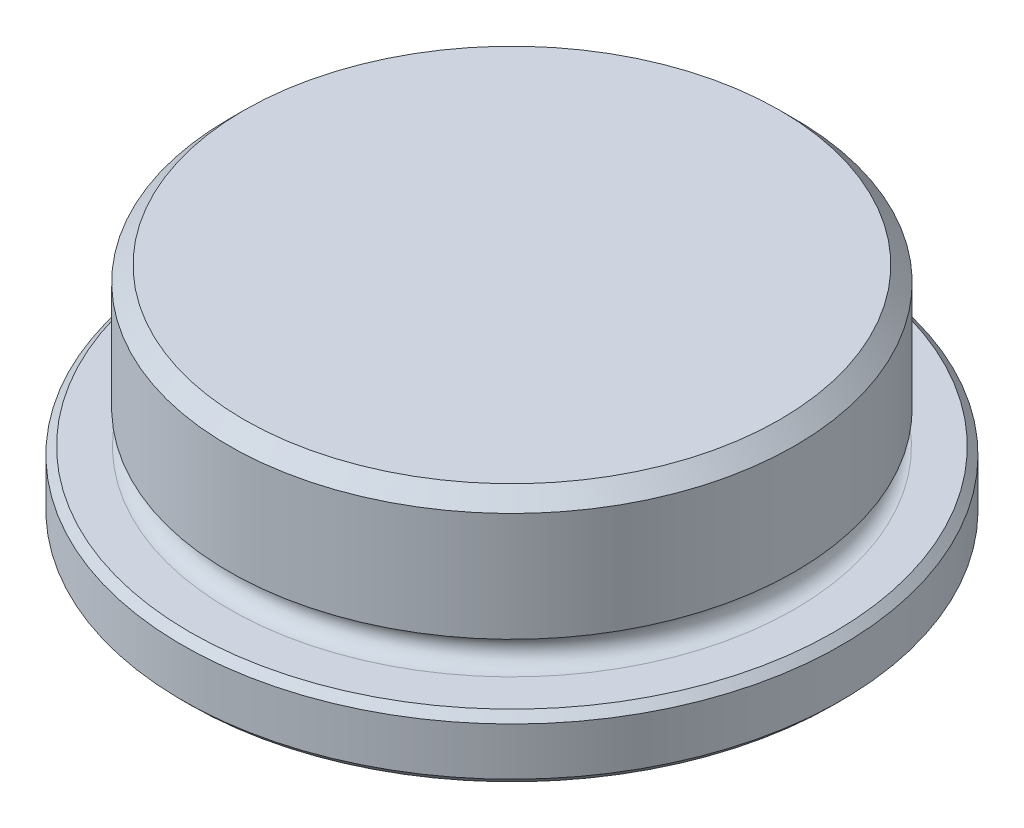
from build123d import *

# Parameters (mm, degrees)
CUT_EXTRUDE1_DEPTH = 7.874


with BuildPart() as part:
    # Sketch1 → Revolve1 (revolve)
    with BuildSketch(Plane.XY, mode=Mode.PRIVATE) as revolve1_sk:
        with BuildLine():
            Line((0, 0), (16.256, 0))
            Line((16.256, 0), (16.637, 0.381))
            Line((16.637, 0.381), (16.637, 2.794))
            Line((16.637, 2.794), (16.256, 3.175))
            Line((16.256, 3.175), (14.666241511, 3.175))
            Line((14.666241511, 3.175), (14.262, 3.175))
            ThreePointArc((14.262, 3.175), (13.474153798, 3.836081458), (13.988383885, 4.726754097))
            Line((13.988383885, 4.726754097), (14.2875, 4.835623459))
            Line((14.2875, 4.835623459), (14.2875, 10.3378))
            Line((14.2875, 10.3378), (13.5255, 11.0998))
            Line((13.5255, 11.0998), (0, 11.0998))
            Line((0, 11.0998), (0, 0))
        make_face()
    revolve(revolve1_sk.sketch.rotate(Axis((0, 11.0998, 0), (0, -1, 0)), 180), axis=Axis((0, 11.0998, 0), (0, -1, 0)))

    # Sketch2 → Cut-Extrude1 (cut)
    with BuildSketch(Plane.XZ):
        Polygon((-2.749630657, 4.7625), (-5.499261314, 0), (-2.749630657, -4.7625), (2.749630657, -4.7625), (5.499261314, 0), (2.749630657, 4.7625), align=None)
    extrude(amount=-CUT_EXTRUDE1_DEPTH, mode=Mode.SUBTRACT)

    # Sketch8 → Cut-Revolve1 (revolve, cut)
    with BuildSketch(Plane.XY, mode=Mode.PRIVATE) as cut_revolve1_sk:
        Polygon((-5.753261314, 0), (-2.049798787, 3.703462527), (0, 3.703462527), (0, 0), align=None)
    revolve(cut_revolve1_sk.sketch.rotate(Axis((0, 3.703462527, 0), (0, -1, 0)), 59.9999999), axis=Axis((0, 3.703462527, 0), (0, -1, 0)), mode=Mode.SUBTRACT)


solid = part.part
